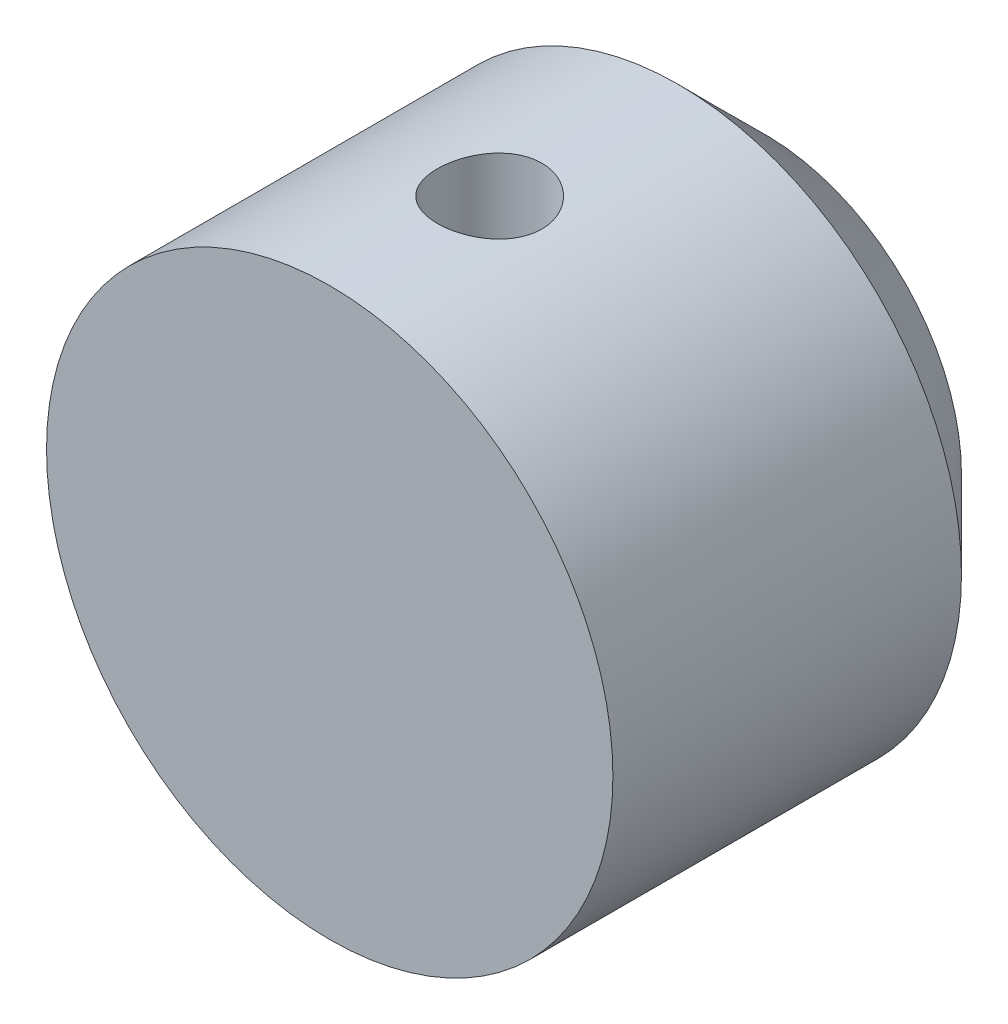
ISO-10303-21;
HEADER;
FILE_DESCRIPTION(('STEP AP214'),'2;1');
FILE_NAME('part.step','',(''),(''),'','','');
FILE_SCHEMA(('AUTOMOTIVE_DESIGN { 1 0 10303 214 1 1 1 1 }'));
ENDSEC;
DATA;
#1=APPLICATION_CONTEXT('core data for automotive mechanical design processes');
#2=APPLICATION_PROTOCOL_DEFINITION('international standard','automotive_design',2000,#1);
#3=PRODUCT_CONTEXT('',#1,'mechanical');
#4=PRODUCT('Part','Part','',(#3));
#5=PRODUCT_RELATED_PRODUCT_CATEGORY('part','',(#4));
#6=PRODUCT_DEFINITION_FORMATION('','',#4);
#7=PRODUCT_DEFINITION_CONTEXT('part definition',#1,'design');
#8=PRODUCT_DEFINITION('design','',#6,#7);
#9=PRODUCT_DEFINITION_SHAPE('','',#8);
#10=(LENGTH_UNIT() NAMED_UNIT(*) SI_UNIT(.MILLI.,.METRE.));
#11=(NAMED_UNIT(*) PLANE_ANGLE_UNIT() SI_UNIT($,.RADIAN.));
#12=(NAMED_UNIT(*) SI_UNIT($,.STERADIAN.) SOLID_ANGLE_UNIT());
#13=UNCERTAINTY_MEASURE_WITH_UNIT(LENGTH_MEASURE(1.E-05),#10,'distance_accuracy_value','');
#14=(GEOMETRIC_REPRESENTATION_CONTEXT(3) GLOBAL_UNCERTAINTY_ASSIGNED_CONTEXT((#13)) GLOBAL_UNIT_ASSIGNED_CONTEXT((#10,
#11,#12)) REPRESENTATION_CONTEXT('',''));
#15=CARTESIAN_POINT('',(0.,0.,0.));
#16=DIRECTION('',(0.,0.,1.));
#17=DIRECTION('',(1.,0.,0.));
#18=AXIS2_PLACEMENT_3D('',#15,#16,#17);
#19=CARTESIAN_POINT('',(0.,0.,50.));
#20=DIRECTION('',(0.,0.,-1.));
#21=DIRECTION('',(-1.,0.,0.));
#22=AXIS2_PLACEMENT_3D('',#19,#20,#21);
#23=CYLINDRICAL_SURFACE('',#22,32.5);
#24=CARTESIAN_POINT('',(0.,0.,10.));
#25=DIRECTION('',(0.,0.,1.));
#26=DIRECTION('',(1.,0.,0.));
#27=AXIS2_PLACEMENT_3D('',#24,#25,#26);
#28=CIRCLE('',#27,32.5);
#29=CARTESIAN_POINT('',(32.5,0.,10.));
#30=VERTEX_POINT('',#29);
#31=EDGE_CURVE('E45',#30,#30,#28,.T.);
#32=ORIENTED_EDGE('',*,*,#31,.T.);
#33=EDGE_LOOP('',(#32));
#34=FACE_BOUND('',#33,.T.);
#35=CARTESIAN_POINT('',(0.,-32.5,37.6507244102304));
#36=CARTESIAN_POINT('',(0.167047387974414,-32.5000014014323,37.6507273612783));
#37=CARTESIAN_POINT('',(0.334056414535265,-32.498709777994,37.6437462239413));
#38=CARTESIAN_POINT('',(0.666922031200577,-32.4935823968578,37.6158814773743));
#39=CARTESIAN_POINT('',(0.832778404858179,-32.4897461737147,37.5949953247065));
#40=CARTESIAN_POINT('',(1.16218709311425,-32.4796320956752,37.539462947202));
#41=CARTESIAN_POINT('',(1.32573803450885,-32.4733528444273,37.5048088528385));
#42=CARTESIAN_POINT('',(1.64934345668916,-32.4585259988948,37.4219954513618));
#43=CARTESIAN_POINT('',(1.80939663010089,-32.449977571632,37.3738311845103));
#44=CARTESIAN_POINT('',(2.12461909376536,-32.4308633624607,37.2644390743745));
#45=CARTESIAN_POINT('',(2.27979434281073,-32.4203001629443,37.2032279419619));
#46=CARTESIAN_POINT('',(2.58446206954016,-32.3974366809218,37.0681347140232));
#47=CARTESIAN_POINT('',(2.73395242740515,-32.3851357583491,36.9942479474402));
#48=CARTESIAN_POINT('',(3.02610605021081,-32.3591437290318,36.8343907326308));
#49=CARTESIAN_POINT('',(3.16877249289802,-32.3454532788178,36.7484259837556));
#50=CARTESIAN_POINT('',(3.44644953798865,-32.3170461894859,36.5649575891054));
#51=CARTESIAN_POINT('',(3.5814572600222,-32.3023291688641,36.4674496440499));
#52=CARTESIAN_POINT('',(3.84417623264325,-32.2721237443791,36.2605558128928));
#53=CARTESIAN_POINT('',(3.97180053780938,-32.2566290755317,36.1510604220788));
#54=CARTESIAN_POINT('',(4.21744501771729,-32.2254324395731,35.9217199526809));
#55=CARTESIAN_POINT('',(4.33546161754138,-32.2097303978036,35.8018710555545));
#56=CARTESIAN_POINT('',(4.56100087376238,-32.1785678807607,35.5527110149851));
#57=CARTESIAN_POINT('',(4.6685266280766,-32.1631073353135,35.4234026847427));
#58=CARTESIAN_POINT('',(4.87241936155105,-32.1328517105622,35.1561193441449));
#59=CARTESIAN_POINT('',(4.96878221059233,-32.1180568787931,35.0181411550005));
#60=CARTESIAN_POINT('',(5.15028638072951,-32.0894539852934,34.7334590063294));
#61=CARTESIAN_POINT('',(5.23534055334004,-32.075653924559,34.5866986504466));
#62=CARTESIAN_POINT('',(5.39279796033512,-32.0495569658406,34.2863452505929));
#63=CARTESIAN_POINT('',(5.46519645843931,-32.0372606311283,34.1327496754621));
#64=CARTESIAN_POINT('',(5.59673049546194,-32.0145447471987,33.819911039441));
#65=CARTESIAN_POINT('',(5.65587180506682,-32.0041243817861,33.6606704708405));
#66=CARTESIAN_POINT('',(5.760491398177,-31.9854579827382,33.3376217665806));
#67=CARTESIAN_POINT('',(5.80596470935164,-31.9772127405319,33.1738119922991));
#68=CARTESIAN_POINT('',(5.92036897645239,-31.9563064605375,32.6811335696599));
#69=CARTESIAN_POINT('',(5.9689190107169,-31.9471824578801,32.347111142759));
#70=CARTESIAN_POINT('',(6.0093777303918,-31.9395955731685,31.675730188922));
#71=CARTESIAN_POINT('',(6.00129133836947,-31.9411317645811,31.3383719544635));
#72=CARTESIAN_POINT('',(5.92929348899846,-31.9545734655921,30.6742148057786));
#73=CARTESIAN_POINT('',(5.86609521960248,-31.9663464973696,30.3473360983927));
#74=CARTESIAN_POINT('',(5.68676990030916,-31.9987323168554,29.7089151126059));
#75=CARTESIAN_POINT('',(5.57064066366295,-32.0193454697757,29.3973734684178));
#76=CARTESIAN_POINT('',(5.28805391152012,-32.0672268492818,28.7963600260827));
#77=CARTESIAN_POINT('',(5.12130716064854,-32.0945331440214,28.5070273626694));
#78=CARTESIAN_POINT('',(4.74242193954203,-32.1526990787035,27.9601805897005));
#79=CARTESIAN_POINT('',(4.530278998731,-32.1835590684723,27.7026696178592));
#80=CARTESIAN_POINT('',(4.06277153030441,-32.2459333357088,27.2226519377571));
#81=CARTESIAN_POINT('',(3.80679653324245,-32.2774504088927,27.0007397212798));
#82=CARTESIAN_POINT('',(3.26093695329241,-32.3371543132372,26.6029184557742));
#83=CARTESIAN_POINT('',(2.97105204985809,-32.3653411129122,26.4270098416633));
#84=CARTESIAN_POINT('',(2.36499021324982,-32.4152628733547,26.1261064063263));
#85=CARTESIAN_POINT('',(2.04878258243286,-32.4369901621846,26.0011720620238));
#86=CARTESIAN_POINT('',(1.39937919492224,-32.4714852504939,25.8063574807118));
#87=CARTESIAN_POINT('',(1.06618519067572,-32.4842539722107,25.7364715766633));
#88=CARTESIAN_POINT('',(0.397383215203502,-32.4992669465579,25.6545620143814));
#89=CARTESIAN_POINT('',(0.0618782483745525,-32.5016593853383,25.6417235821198));
#90=CARTESIAN_POINT('',(-0.606484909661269,-32.4960590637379,25.6720897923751));
#91=CARTESIAN_POINT('',(-0.939343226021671,-32.4880667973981,25.7152917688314));
#92=CARTESIAN_POINT('',(-1.59038992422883,-32.4626872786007,25.8558349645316));
#93=CARTESIAN_POINT('',(-1.90867005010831,-32.4453713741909,25.9527651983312));
#94=CARTESIAN_POINT('',(-2.52446187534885,-32.4032781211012,26.1975697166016));
#95=CARTESIAN_POINT('',(-2.82197219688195,-32.3785002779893,26.3454473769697));
#96=CARTESIAN_POINT('',(-3.39126548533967,-32.3238620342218,26.6897611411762));
#97=CARTESIAN_POINT('',(-3.66274135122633,-32.2939504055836,26.8866967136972));
#98=CARTESIAN_POINT('',(-4.16908432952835,-32.2324977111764,27.3228597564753));
#99=CARTESIAN_POINT('',(-4.40394813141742,-32.2009564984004,27.5620910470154));
#100=CARTESIAN_POINT('',(-4.83348551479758,-32.1393095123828,28.0797339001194));
#101=CARTESIAN_POINT('',(-5.02760384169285,-32.1092273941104,28.3586094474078));
#102=CARTESIAN_POINT('',(-5.36623841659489,-32.0543763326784,28.9455030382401));
#103=CARTESIAN_POINT('',(-5.51075647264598,-32.0296071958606,29.2535200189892));
#104=CARTESIAN_POINT('',(-5.74529998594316,-31.9883683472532,29.8884582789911));
#105=CARTESIAN_POINT('',(-5.83558308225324,-31.9718594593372,30.215281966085));
#106=CARTESIAN_POINT('',(-5.9598710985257,-31.9489294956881,30.8799799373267));
#107=CARTESIAN_POINT('',(-5.9938821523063,-31.9425073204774,31.2178530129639));
#108=CARTESIAN_POINT('',(-6.00189486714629,-31.9409937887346,31.7224025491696));
#109=CARTESIAN_POINT('',(-5.99758283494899,-31.9418077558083,31.8889985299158));
#110=CARTESIAN_POINT('',(-5.97513253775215,-31.9460164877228,32.2212065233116));
#111=CARTESIAN_POINT('',(-5.95699949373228,-31.949410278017,32.386818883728));
#112=CARTESIAN_POINT('',(-5.90703362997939,-31.9586855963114,32.7159400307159));
#113=CARTESIAN_POINT('',(-5.87519596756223,-31.9645680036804,32.8794480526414));
#114=CARTESIAN_POINT('',(-5.79808429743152,-31.9786453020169,33.2031026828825));
#115=CARTESIAN_POINT('',(-5.75281510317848,-31.9868393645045,33.3632504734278));
#116=CARTESIAN_POINT('',(-5.6492524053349,-32.00529184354,33.6789010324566));
#117=CARTESIAN_POINT('',(-5.59097742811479,-32.0155473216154,33.8344100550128));
#118=CARTESIAN_POINT('',(-5.46182056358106,-32.0378339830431,34.1399026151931));
#119=CARTESIAN_POINT('',(-5.39094316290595,-32.049864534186,34.2898880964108));
#120=CARTESIAN_POINT('',(-5.23704527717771,-32.0753712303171,34.5834420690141));
#121=CARTESIAN_POINT('',(-5.154019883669,-32.0888479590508,34.727007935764));
#122=CARTESIAN_POINT('',(-4.97646002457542,-32.1168634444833,35.0066548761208));
#123=CARTESIAN_POINT('',(-4.88192955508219,-32.1314018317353,35.1427385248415));
#124=CARTESIAN_POINT('',(-4.68049098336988,-32.1613669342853,35.4085461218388));
#125=CARTESIAN_POINT('',(-4.57341948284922,-32.1768036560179,35.5381451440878));
#126=CARTESIAN_POINT('',(-4.34884138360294,-32.2079248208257,35.787844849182));
#127=CARTESIAN_POINT('',(-4.23133849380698,-32.2236091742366,35.9079488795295));
#128=CARTESIAN_POINT('',(-3.98659111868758,-32.2548029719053,36.137962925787));
#129=CARTESIAN_POINT('',(-3.85934088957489,-32.2703123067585,36.247866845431));
#130=CARTESIAN_POINT('',(-3.59607102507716,-32.3007093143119,36.456604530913));
#131=CARTESIAN_POINT('',(-3.46005463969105,-32.3155972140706,36.5554423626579));
#132=CARTESIAN_POINT('',(-3.17885786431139,-32.3444742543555,36.7422479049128));
#133=CARTESIAN_POINT('',(-3.03360543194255,-32.3584539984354,36.8301086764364));
#134=CARTESIAN_POINT('',(-2.7361329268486,-32.384963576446,36.9932277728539));
#135=CARTESIAN_POINT('',(-2.58391544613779,-32.3974939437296,37.0684907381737));
#136=CARTESIAN_POINT('',(-2.27362825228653,-32.4207463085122,37.2058459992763));
#137=CARTESIAN_POINT('',(-2.11556241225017,-32.4314694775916,37.267946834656));
#138=CARTESIAN_POINT('',(-1.79467228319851,-32.4508090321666,37.3785478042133));
#139=CARTESIAN_POINT('',(-1.63184896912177,-32.4594258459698,37.427050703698));
#140=CARTESIAN_POINT('',(-1.22783758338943,-32.4776798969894,37.5289290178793));
#141=CARTESIAN_POINT('',(-0.984588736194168,-32.4860086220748,37.5745439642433));
#142=CARTESIAN_POINT('',(-0.494198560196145,-32.4971675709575,37.6354391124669));
#143=CARTESIAN_POINT('',(-0.247057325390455,-32.4999979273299,37.6507200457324));
#144=CARTESIAN_POINT('',(0.,-32.5,37.6507244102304));
#145=B_SPLINE_CURVE_WITH_KNOTS('',3,(#35,#36,#37,#38,#39,#40,#41,#42,#43,#44,#45,#46,#47,#48,
#49,#50,#51,#52,#53,#54,#55,#56,#57,#58,#59,#60,#61,#62,#63,#64,#65,#66,#67,#68,#69,#70,#71,#72,
#73,#74,#75,#76,#77,#78,#79,#80,#81,#82,#83,#84,#85,#86,#87,#88,#89,#90,#91,#92,#93,#94,#95,#96,
#97,#98,#99,#100,#101,#102,#103,#104,#105,#106,#107,#108,#109,#110,#111,#112,#113,#114,#115,
#116,#117,#118,#119,#120,#121,#122,#123,#124,#125,#126,#127,#128,#129,#130,#131,#132,#133,#134,
#135,#136,#137,#138,#139,#140,#141,#142,#143,#144),.UNSPECIFIED.,.T.,.F.,(4,2,2,2,2,2,2,2,2,2,2,
2,2,2,2,2,2,2,2,2,2,2,2,2,2,2,2,2,2,2,2,2,2,2,2,2,2,2,2,2,2,2,2,2,2,2,2,2,2,2,2,2,2,2,4),(0.,
0.500925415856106,1.00194248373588,1.50324633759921,2.00473446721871,2.50558409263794,
3.00661868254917,3.5074176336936,4.00840369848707,4.51442366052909,5.02063105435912,
5.52668851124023,6.03293260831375,6.54287614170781,7.05301011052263,7.56292159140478,
8.07301835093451,9.08064758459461,10.088189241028,11.0828828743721,12.0776176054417,
13.0781469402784,14.0787748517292,15.0946807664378,16.1105962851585,17.1277136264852,
18.144726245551,19.147165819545,20.1495577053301,21.1443857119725,22.1392796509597,
23.1447493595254,24.1503099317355,25.1687925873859,26.1872381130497,27.2008065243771,
28.2142644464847,28.7137382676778,29.2130235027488,29.7124853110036,30.2117683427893,
30.7103446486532,31.2087438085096,31.7073449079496,32.2057733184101,32.711626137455,
33.2172998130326,33.7232737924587,34.2290612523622,34.7394448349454,35.2496400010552,
35.7595031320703,36.2692625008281,37.0101317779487,37.7509831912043),.UNSPECIFIED.);
#146=CARTESIAN_POINT('',(0.,-32.5,37.6507244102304));
#147=VERTEX_POINT('',#146);
#148=EDGE_CURVE('E50',#147,#147,#145,.T.);
#149=ORIENTED_EDGE('',*,*,#148,.T.);
#150=EDGE_LOOP('',(#149));
#151=FACE_BOUND('',#150,.T.);
#152=CARTESIAN_POINT('',(0.,32.5,37.6507244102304));
#153=CARTESIAN_POINT('',(-0.167047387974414,32.5000014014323,37.6507273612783));
#154=CARTESIAN_POINT('',(-0.334056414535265,32.498709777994,37.6437462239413));
#155=CARTESIAN_POINT('',(-0.666922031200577,32.4935823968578,37.6158814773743));
#156=CARTESIAN_POINT('',(-0.832778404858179,32.4897461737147,37.5949953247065));
#157=CARTESIAN_POINT('',(-1.16218709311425,32.4796320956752,37.539462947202));
#158=CARTESIAN_POINT('',(-1.32573803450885,32.4733528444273,37.5048088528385));
#159=CARTESIAN_POINT('',(-1.64934345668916,32.4585259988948,37.4219954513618));
#160=CARTESIAN_POINT('',(-1.80939663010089,32.449977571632,37.3738311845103));
#161=CARTESIAN_POINT('',(-2.12461909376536,32.4308633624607,37.2644390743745));
#162=CARTESIAN_POINT('',(-2.27979434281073,32.4203001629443,37.2032279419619));
#163=CARTESIAN_POINT('',(-2.58446206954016,32.3974366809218,37.0681347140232));
#164=CARTESIAN_POINT('',(-2.73395242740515,32.3851357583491,36.9942479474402));
#165=CARTESIAN_POINT('',(-3.02610605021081,32.3591437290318,36.8343907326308));
#166=CARTESIAN_POINT('',(-3.16877249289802,32.3454532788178,36.7484259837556));
#167=CARTESIAN_POINT('',(-3.44644953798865,32.3170461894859,36.5649575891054));
#168=CARTESIAN_POINT('',(-3.5814572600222,32.3023291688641,36.4674496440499));
#169=CARTESIAN_POINT('',(-3.84417623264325,32.2721237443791,36.2605558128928));
#170=CARTESIAN_POINT('',(-3.97180053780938,32.2566290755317,36.1510604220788));
#171=CARTESIAN_POINT('',(-4.21744501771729,32.2254324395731,35.9217199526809));
#172=CARTESIAN_POINT('',(-4.33546161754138,32.2097303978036,35.8018710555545));
#173=CARTESIAN_POINT('',(-4.56100087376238,32.1785678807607,35.5527110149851));
#174=CARTESIAN_POINT('',(-4.6685266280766,32.1631073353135,35.4234026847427));
#175=CARTESIAN_POINT('',(-4.87241936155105,32.1328517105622,35.1561193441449));
#176=CARTESIAN_POINT('',(-4.96878221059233,32.1180568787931,35.0181411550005));
#177=CARTESIAN_POINT('',(-5.15028638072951,32.0894539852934,34.7334590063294));
#178=CARTESIAN_POINT('',(-5.23534055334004,32.075653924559,34.5866986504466));
#179=CARTESIAN_POINT('',(-5.39279796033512,32.0495569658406,34.2863452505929));
#180=CARTESIAN_POINT('',(-5.46519645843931,32.0372606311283,34.1327496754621));
#181=CARTESIAN_POINT('',(-5.59673049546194,32.0145447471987,33.819911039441));
#182=CARTESIAN_POINT('',(-5.65587180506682,32.0041243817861,33.6606704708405));
#183=CARTESIAN_POINT('',(-5.760491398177,31.9854579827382,33.3376217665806));
#184=CARTESIAN_POINT('',(-5.80596470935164,31.9772127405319,33.1738119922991));
#185=CARTESIAN_POINT('',(-5.92036897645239,31.9563064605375,32.6811335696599));
#186=CARTESIAN_POINT('',(-5.9689190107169,31.9471824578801,32.347111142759));
#187=CARTESIAN_POINT('',(-6.0093777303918,31.9395955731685,31.675730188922));
#188=CARTESIAN_POINT('',(-6.00129133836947,31.9411317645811,31.3383719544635));
#189=CARTESIAN_POINT('',(-5.92929348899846,31.9545734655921,30.6742148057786));
#190=CARTESIAN_POINT('',(-5.86609521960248,31.9663464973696,30.3473360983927));
#191=CARTESIAN_POINT('',(-5.68676990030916,31.9987323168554,29.7089151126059));
#192=CARTESIAN_POINT('',(-5.57064066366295,32.0193454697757,29.3973734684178));
#193=CARTESIAN_POINT('',(-5.28805391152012,32.0672268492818,28.7963600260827));
#194=CARTESIAN_POINT('',(-5.12130716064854,32.0945331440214,28.5070273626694));
#195=CARTESIAN_POINT('',(-4.74242193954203,32.1526990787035,27.9601805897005));
#196=CARTESIAN_POINT('',(-4.530278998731,32.1835590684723,27.7026696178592));
#197=CARTESIAN_POINT('',(-4.06277153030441,32.2459333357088,27.2226519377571));
#198=CARTESIAN_POINT('',(-3.80679653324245,32.2774504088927,27.0007397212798));
#199=CARTESIAN_POINT('',(-3.26093695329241,32.3371543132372,26.6029184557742));
#200=CARTESIAN_POINT('',(-2.97105204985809,32.3653411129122,26.4270098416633));
#201=CARTESIAN_POINT('',(-2.36499021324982,32.4152628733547,26.1261064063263));
#202=CARTESIAN_POINT('',(-2.04878258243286,32.4369901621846,26.0011720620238));
#203=CARTESIAN_POINT('',(-1.39937919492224,32.4714852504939,25.8063574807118));
#204=CARTESIAN_POINT('',(-1.06618519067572,32.4842539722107,25.7364715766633));
#205=CARTESIAN_POINT('',(-0.397383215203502,32.4992669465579,25.6545620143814));
#206=CARTESIAN_POINT('',(-0.0618782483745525,32.5016593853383,25.6417235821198));
#207=CARTESIAN_POINT('',(0.606484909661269,32.4960590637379,25.6720897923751));
#208=CARTESIAN_POINT('',(0.939343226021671,32.4880667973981,25.7152917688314));
#209=CARTESIAN_POINT('',(1.59038992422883,32.4626872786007,25.8558349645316));
#210=CARTESIAN_POINT('',(1.90867005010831,32.4453713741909,25.9527651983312));
#211=CARTESIAN_POINT('',(2.52446187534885,32.4032781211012,26.1975697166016));
#212=CARTESIAN_POINT('',(2.82197219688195,32.3785002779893,26.3454473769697));
#213=CARTESIAN_POINT('',(3.39126548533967,32.3238620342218,26.6897611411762));
#214=CARTESIAN_POINT('',(3.66274135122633,32.2939504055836,26.8866967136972));
#215=CARTESIAN_POINT('',(4.16908432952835,32.2324977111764,27.3228597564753));
#216=CARTESIAN_POINT('',(4.40394813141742,32.2009564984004,27.5620910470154));
#217=CARTESIAN_POINT('',(4.83348551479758,32.1393095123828,28.0797339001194));
#218=CARTESIAN_POINT('',(5.02760384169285,32.1092273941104,28.3586094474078));
#219=CARTESIAN_POINT('',(5.36623841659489,32.0543763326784,28.9455030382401));
#220=CARTESIAN_POINT('',(5.51075647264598,32.0296071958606,29.2535200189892));
#221=CARTESIAN_POINT('',(5.74529998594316,31.9883683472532,29.8884582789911));
#222=CARTESIAN_POINT('',(5.83558308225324,31.9718594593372,30.215281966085));
#223=CARTESIAN_POINT('',(5.9598710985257,31.9489294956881,30.8799799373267));
#224=CARTESIAN_POINT('',(5.9938821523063,31.9425073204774,31.2178530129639));
#225=CARTESIAN_POINT('',(6.00189486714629,31.9409937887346,31.7224025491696));
#226=CARTESIAN_POINT('',(5.99758283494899,31.9418077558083,31.8889985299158));
#227=CARTESIAN_POINT('',(5.97513253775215,31.9460164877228,32.2212065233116));
#228=CARTESIAN_POINT('',(5.95699949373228,31.949410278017,32.386818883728));
#229=CARTESIAN_POINT('',(5.90703362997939,31.9586855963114,32.7159400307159));
#230=CARTESIAN_POINT('',(5.87519596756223,31.9645680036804,32.8794480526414));
#231=CARTESIAN_POINT('',(5.79808429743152,31.9786453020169,33.2031026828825));
#232=CARTESIAN_POINT('',(5.75281510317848,31.9868393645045,33.3632504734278));
#233=CARTESIAN_POINT('',(5.6492524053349,32.00529184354,33.6789010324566));
#234=CARTESIAN_POINT('',(5.59097742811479,32.0155473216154,33.8344100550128));
#235=CARTESIAN_POINT('',(5.46182056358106,32.0378339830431,34.1399026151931));
#236=CARTESIAN_POINT('',(5.39094316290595,32.049864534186,34.2898880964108));
#237=CARTESIAN_POINT('',(5.23704527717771,32.0753712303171,34.5834420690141));
#238=CARTESIAN_POINT('',(5.154019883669,32.0888479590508,34.727007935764));
#239=CARTESIAN_POINT('',(4.97646002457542,32.1168634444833,35.0066548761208));
#240=CARTESIAN_POINT('',(4.88192955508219,32.1314018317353,35.1427385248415));
#241=CARTESIAN_POINT('',(4.68049098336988,32.1613669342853,35.4085461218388));
#242=CARTESIAN_POINT('',(4.57341948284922,32.1768036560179,35.5381451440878));
#243=CARTESIAN_POINT('',(4.34884138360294,32.2079248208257,35.787844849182));
#244=CARTESIAN_POINT('',(4.23133849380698,32.2236091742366,35.9079488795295));
#245=CARTESIAN_POINT('',(3.98659111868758,32.2548029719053,36.137962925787));
#246=CARTESIAN_POINT('',(3.85934088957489,32.2703123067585,36.247866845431));
#247=CARTESIAN_POINT('',(3.59607102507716,32.3007093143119,36.456604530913));
#248=CARTESIAN_POINT('',(3.46005463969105,32.3155972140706,36.5554423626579));
#249=CARTESIAN_POINT('',(3.17885786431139,32.3444742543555,36.7422479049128));
#250=CARTESIAN_POINT('',(3.03360543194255,32.3584539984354,36.8301086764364));
#251=CARTESIAN_POINT('',(2.7361329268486,32.384963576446,36.9932277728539));
#252=CARTESIAN_POINT('',(2.58391544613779,32.3974939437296,37.0684907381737));
#253=CARTESIAN_POINT('',(2.27362825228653,32.4207463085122,37.2058459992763));
#254=CARTESIAN_POINT('',(2.11556241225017,32.4314694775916,37.267946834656));
#255=CARTESIAN_POINT('',(1.79467228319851,32.4508090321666,37.3785478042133));
#256=CARTESIAN_POINT('',(1.63184896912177,32.4594258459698,37.427050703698));
#257=CARTESIAN_POINT('',(1.22783758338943,32.4776798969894,37.5289290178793));
#258=CARTESIAN_POINT('',(0.984588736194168,32.4860086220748,37.5745439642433));
#259=CARTESIAN_POINT('',(0.494198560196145,32.4971675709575,37.6354391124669));
#260=CARTESIAN_POINT('',(0.247057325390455,32.4999979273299,37.6507200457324));
#261=CARTESIAN_POINT('',(0.,32.5,37.6507244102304));
#262=B_SPLINE_CURVE_WITH_KNOTS('',3,(#152,#153,#154,#155,#156,#157,#158,#159,#160,#161,#162,
#163,#164,#165,#166,#167,#168,#169,#170,#171,#172,#173,#174,#175,#176,#177,#178,#179,#180,#181,
#182,#183,#184,#185,#186,#187,#188,#189,#190,#191,#192,#193,#194,#195,#196,#197,#198,#199,#200,
#201,#202,#203,#204,#205,#206,#207,#208,#209,#210,#211,#212,#213,#214,#215,#216,#217,#218,#219,
#220,#221,#222,#223,#224,#225,#226,#227,#228,#229,#230,#231,#232,#233,#234,#235,#236,#237,#238,
#239,#240,#241,#242,#243,#244,#245,#246,#247,#248,#249,#250,#251,#252,#253,#254,#255,#256,#257,
#258,#259,#260,#261),.UNSPECIFIED.,.T.,.F.,(4,2,2,2,2,2,2,2,2,2,2,2,2,2,2,2,2,2,2,2,2,2,2,2,2,2,
2,2,2,2,2,2,2,2,2,2,2,2,2,2,2,2,2,2,2,2,2,2,2,2,2,2,2,2,4),(0.,0.500925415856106,
1.00194248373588,1.50324633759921,2.00473446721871,2.50558409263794,3.00661868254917,
3.5074176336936,4.00840369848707,4.51442366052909,5.02063105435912,5.52668851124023,
6.03293260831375,6.54287614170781,7.05301011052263,7.56292159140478,8.07301835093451,
9.08064758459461,10.088189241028,11.0828828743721,12.0776176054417,13.0781469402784,
14.0787748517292,15.0946807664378,16.1105962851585,17.1277136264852,18.144726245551,
19.147165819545,20.1495577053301,21.1443857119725,22.1392796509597,23.1447493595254,
24.1503099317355,25.1687925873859,26.1872381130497,27.2008065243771,28.2142644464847,
28.7137382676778,29.2130235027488,29.7124853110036,30.2117683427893,30.7103446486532,
31.2087438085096,31.7073449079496,32.2057733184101,32.711626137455,33.2172998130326,
33.7232737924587,34.2290612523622,34.7394448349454,35.2496400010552,35.7595031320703,
36.2692625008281,37.0101317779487,37.7509831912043),.UNSPECIFIED.);
#263=CARTESIAN_POINT('',(0.,32.5,37.6507244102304));
#264=VERTEX_POINT('',#263);
#265=EDGE_CURVE('E55',#264,#264,#262,.T.);
#266=ORIENTED_EDGE('',*,*,#265,.T.);
#267=EDGE_LOOP('',(#266));
#268=FACE_BOUND('',#267,.T.);
#269=CARTESIAN_POINT('',(0.,0.,50.));
#270=DIRECTION('',(0.,0.,1.));
#271=DIRECTION('',(1.,0.,0.));
#272=AXIS2_PLACEMENT_3D('',#269,#270,#271);
#273=CIRCLE('',#272,32.5);
#274=CARTESIAN_POINT('',(32.5,0.,50.));
#275=VERTEX_POINT('',#274);
#276=EDGE_CURVE('E92',#275,#275,#273,.T.);
#277=ORIENTED_EDGE('',*,*,#276,.F.);
#278=EDGE_LOOP('',(#277));
#279=FACE_BOUND('',#278,.T.);
#280=ADVANCED_FACE('F37',(#34,#151,#268,#279),#23,.T.);
#281=CARTESIAN_POINT('',(0.,0.,50.));
#282=DIRECTION('',(0.,0.,1.));
#283=DIRECTION('',(1.,0.,0.));
#284=AXIS2_PLACEMENT_3D('',#281,#282,#283);
#285=PLANE('',#284);
#286=ORIENTED_EDGE('',*,*,#276,.T.);
#287=EDGE_LOOP('',(#286));
#288=FACE_BOUND('',#287,.T.);
#289=ADVANCED_FACE('F74',(#288),#285,.T.);
#290=CARTESIAN_POINT('',(0.,0.,0.));
#291=DIRECTION('',(0.,0.,1.));
#292=DIRECTION('',(1.,0.,0.));
#293=AXIS2_PLACEMENT_3D('',#290,#291,#292);
#294=PLANE('',#293);
#295=CARTESIAN_POINT('',(0.,0.,0.));
#296=DIRECTION('',(0.,0.,1.));
#297=DIRECTION('',(1.,0.,0.));
#298=AXIS2_PLACEMENT_3D('',#295,#296,#297);
#299=CIRCLE('',#298,22.5);
#300=CARTESIAN_POINT('',(22.5,0.,0.));
#301=VERTEX_POINT('',#300);
#302=EDGE_CURVE('E10',#301,#301,#299,.F.);
#303=ORIENTED_EDGE('',*,*,#302,.T.);
#304=EDGE_LOOP('',(#303));
#305=FACE_BOUND('',#304,.T.);
#306=ADVANCED_FACE('F72',(#305),#294,.F.);
#307=CARTESIAN_POINT('',(0.,-32.5,31.6507244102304));
#308=DIRECTION('',(0.,1.,0.));
#309=DIRECTION('',(0.,0.,1.));
#310=AXIS2_PLACEMENT_3D('',#307,#308,#309);
#311=CYLINDRICAL_SURFACE('',#310,6.);
#312=ORIENTED_EDGE('',*,*,#265,.F.);
#313=EDGE_LOOP('',(#312));
#314=FACE_BOUND('',#313,.T.);
#315=ORIENTED_EDGE('',*,*,#148,.F.);
#316=EDGE_LOOP('',(#315));
#317=FACE_BOUND('',#316,.T.);
#318=ADVANCED_FACE('F68',(#314,#317),#311,.F.);
#319=CARTESIAN_POINT('',(0.,0.,10.));
#320=DIRECTION('',(0.,0.,1.));
#321=DIRECTION('',(1.,0.,0.));
#322=AXIS2_PLACEMENT_3D('',#319,#320,#321);
#323=CONICAL_SURFACE('',#322,32.5,0.785398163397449);
#324=ORIENTED_EDGE('',*,*,#302,.F.);
#325=EDGE_LOOP('',(#324));
#326=FACE_BOUND('',#325,.T.);
#327=ORIENTED_EDGE('',*,*,#31,.F.);
#328=EDGE_LOOP('',(#327));
#329=FACE_BOUND('',#328,.T.);
#330=ADVANCED_FACE('F39',(#326,#329),#323,.T.);
#331=CLOSED_SHELL('',(#280,#289,#306,#318,#330));
#332=MANIFOLD_SOLID_BREP('B2',#331);
#333=ADVANCED_BREP_SHAPE_REPRESENTATION('',(#18,#332),#14);
#334=SHAPE_DEFINITION_REPRESENTATION(#9,#333);
ENDSEC;
END-ISO-10303-21;
